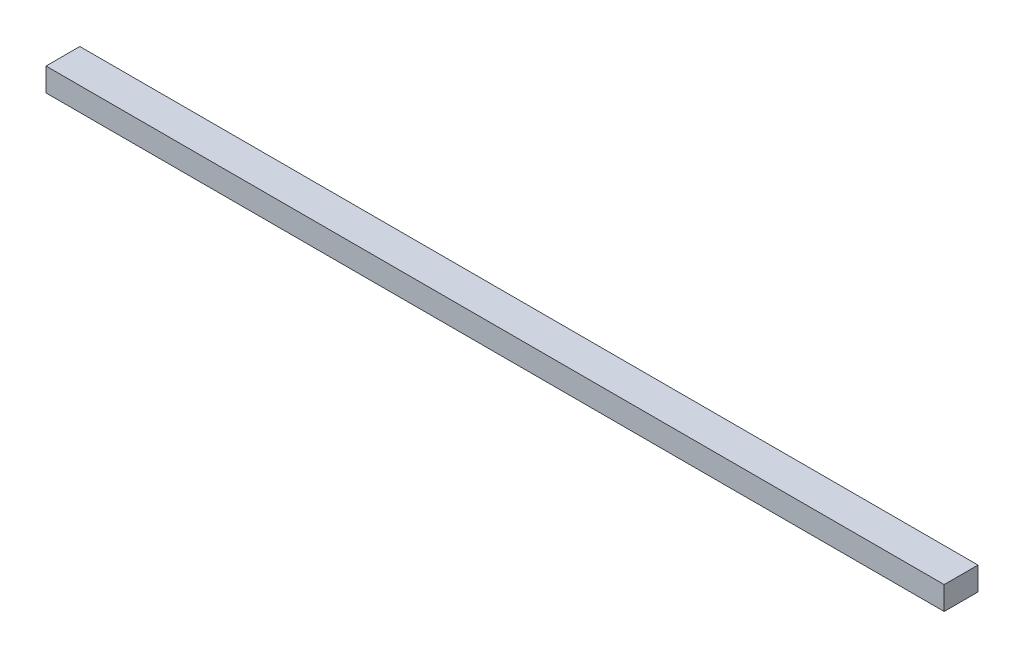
from build123d import *

# Parameters (mm, degrees)
SKETCH1_W           = 488.95
SKETCH1_H           = 18.415
BOSS_EXTRUDE1_DEPTH = 12.7


with BuildPart() as part:
    # Sketch1 → Boss-Extrude1 (new body)
    with BuildSketch(Plane(origin=(0, 0, 0), x_dir=(1, 0, 0), z_dir=(0, 1, 0))):
        Rectangle(SKETCH1_W, SKETCH1_H)
    extrude(amount=BOSS_EXTRUDE1_DEPTH)


solid = part.part
